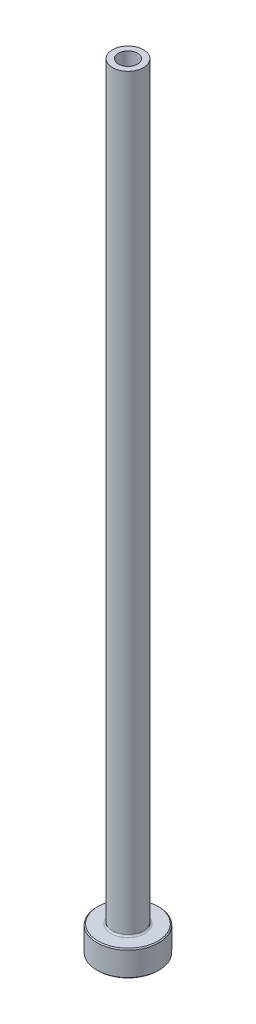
ISO-10303-21;
HEADER;
FILE_DESCRIPTION(('STEP AP214'),'2;1');
FILE_NAME('part.step','',(''),(''),'','','');
FILE_SCHEMA(('AUTOMOTIVE_DESIGN { 1 0 10303 214 1 1 1 1 }'));
ENDSEC;
DATA;
#1=APPLICATION_CONTEXT('core data for automotive mechanical design processes');
#2=APPLICATION_PROTOCOL_DEFINITION('international standard','automotive_design',2000,#1);
#3=PRODUCT_CONTEXT('',#1,'mechanical');
#4=PRODUCT('Part','Part','',(#3));
#5=PRODUCT_RELATED_PRODUCT_CATEGORY('part','',(#4));
#6=PRODUCT_DEFINITION_FORMATION('','',#4);
#7=PRODUCT_DEFINITION_CONTEXT('part definition',#1,'design');
#8=PRODUCT_DEFINITION('design','',#6,#7);
#9=PRODUCT_DEFINITION_SHAPE('','',#8);
#10=(LENGTH_UNIT() NAMED_UNIT(*) SI_UNIT(.MILLI.,.METRE.));
#11=(NAMED_UNIT(*) PLANE_ANGLE_UNIT() SI_UNIT($,.RADIAN.));
#12=(NAMED_UNIT(*) SI_UNIT($,.STERADIAN.) SOLID_ANGLE_UNIT());
#13=UNCERTAINTY_MEASURE_WITH_UNIT(LENGTH_MEASURE(1.E-05),#10,'distance_accuracy_value','');
#14=(GEOMETRIC_REPRESENTATION_CONTEXT(3) GLOBAL_UNCERTAINTY_ASSIGNED_CONTEXT((#13)) GLOBAL_UNIT_ASSIGNED_CONTEXT((#10,
#11,#12)) REPRESENTATION_CONTEXT('',''));
#15=CARTESIAN_POINT('',(0.,0.,0.));
#16=DIRECTION('',(0.,0.,1.));
#17=DIRECTION('',(1.,0.,0.));
#18=AXIS2_PLACEMENT_3D('',#15,#16,#17);
#19=CARTESIAN_POINT('',(0.,92.1876809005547,0.));
#20=DIRECTION('',(0.,1.,0.));
#21=DIRECTION('',(0.,0.,1.));
#22=AXIS2_PLACEMENT_3D('',#19,#20,#21);
#23=CYLINDRICAL_SURFACE('',#22,1.85);
#24=CARTESIAN_POINT('',(0.,150.,0.));
#25=DIRECTION('',(0.,1.,0.));
#26=DIRECTION('',(0.,0.,1.));
#27=AXIS2_PLACEMENT_3D('',#24,#25,#26);
#28=CIRCLE('',#27,1.85);
#29=CARTESIAN_POINT('',(0.,150.,1.85));
#30=VERTEX_POINT('',#29);
#31=EDGE_CURVE('E62',#30,#30,#28,.T.);
#32=ORIENTED_EDGE('',*,*,#31,.T.);
#33=EDGE_LOOP('',(#32));
#34=FACE_BOUND('',#33,.T.);
#35=CARTESIAN_POINT('',(0.,105.,0.));
#36=DIRECTION('',(0.,1.,0.));
#37=DIRECTION('',(0.,0.,1.));
#38=AXIS2_PLACEMENT_3D('',#35,#36,#37);
#39=CIRCLE('',#38,1.85);
#40=CARTESIAN_POINT('',(0.,105.,1.85));
#41=VERTEX_POINT('',#40);
#42=EDGE_CURVE('E71',#41,#41,#39,.T.);
#43=ORIENTED_EDGE('',*,*,#42,.F.);
#44=EDGE_LOOP('',(#43));
#45=FACE_BOUND('',#44,.T.);
#46=ADVANCED_FACE('F30',(#34,#45),#23,.F.);
#47=CARTESIAN_POINT('',(-1.85,150.,0.));
#48=DIRECTION('',(0.,1.,0.));
#49=DIRECTION('',(0.,0.,1.));
#50=AXIS2_PLACEMENT_3D('',#47,#48,#49);
#51=PLANE('',#50);
#52=CARTESIAN_POINT('',(0.,150.,0.));
#53=DIRECTION('',(0.,1.,0.));
#54=DIRECTION('',(0.,0.,1.));
#55=AXIS2_PLACEMENT_3D('',#52,#53,#54);
#56=CIRCLE('',#55,3.00000000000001);
#57=CARTESIAN_POINT('',(0.,150.,3.00000000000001));
#58=VERTEX_POINT('',#57);
#59=EDGE_CURVE('E65',#58,#58,#56,.T.);
#60=ORIENTED_EDGE('',*,*,#59,.T.);
#61=EDGE_LOOP('',(#60));
#62=FACE_BOUND('',#61,.T.);
#63=ORIENTED_EDGE('',*,*,#31,.F.);
#64=EDGE_LOOP('',(#63));
#65=FACE_BOUND('',#64,.T.);
#66=ADVANCED_FACE('F79',(#62,#65),#51,.T.);
#67=CARTESIAN_POINT('',(0.,92.1876809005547,0.));
#68=DIRECTION('',(0.,1.,0.));
#69=DIRECTION('',(0.,0.,1.));
#70=AXIS2_PLACEMENT_3D('',#67,#68,#69);
#71=CYLINDRICAL_SURFACE('',#70,3.);
#72=CARTESIAN_POINT('',(0.,5.3,0.));
#73=DIRECTION('',(0.,1.,0.));
#74=DIRECTION('',(0.,0.,1.));
#75=AXIS2_PLACEMENT_3D('',#72,#73,#74);
#76=CIRCLE('',#75,3.);
#77=CARTESIAN_POINT('',(0.,5.3,3.));
#78=VERTEX_POINT('',#77);
#79=EDGE_CURVE('E59',#78,#78,#76,.T.);
#80=ORIENTED_EDGE('',*,*,#79,.T.);
#81=EDGE_LOOP('',(#80));
#82=FACE_BOUND('',#81,.T.);
#83=ORIENTED_EDGE('',*,*,#59,.F.);
#84=EDGE_LOOP('',(#83));
#85=FACE_BOUND('',#84,.T.);
#86=ADVANCED_FACE('F85',(#82,#85),#71,.T.);
#87=CARTESIAN_POINT('',(-2.99999999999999,5.,0.));
#88=DIRECTION('',(0.,1.,0.));
#89=DIRECTION('',(0.,0.,1.));
#90=AXIS2_PLACEMENT_3D('',#87,#88,#89);
#91=PLANE('',#90);
#92=CARTESIAN_POINT('',(0.,5.,0.));
#93=DIRECTION('',(0.,1.,0.));
#94=DIRECTION('',(0.,0.,1.));
#95=AXIS2_PLACEMENT_3D('',#92,#93,#94);
#96=CIRCLE('',#95,5.80000000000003);
#97=CARTESIAN_POINT('',(0.,5.,5.80000000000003));
#98=VERTEX_POINT('',#97);
#99=EDGE_CURVE('E53',#98,#98,#96,.T.);
#100=ORIENTED_EDGE('',*,*,#99,.T.);
#101=EDGE_LOOP('',(#100));
#102=FACE_BOUND('',#101,.T.);
#103=CARTESIAN_POINT('',(0.,5.,0.));
#104=DIRECTION('',(0.,1.,0.));
#105=DIRECTION('',(0.,0.,1.));
#106=AXIS2_PLACEMENT_3D('',#103,#104,#105);
#107=CIRCLE('',#106,3.3);
#108=CARTESIAN_POINT('',(0.,5.,3.3));
#109=VERTEX_POINT('',#108);
#110=EDGE_CURVE('E56',#109,#109,#107,.F.);
#111=ORIENTED_EDGE('',*,*,#110,.T.);
#112=EDGE_LOOP('',(#111));
#113=FACE_BOUND('',#112,.T.);
#114=ADVANCED_FACE('F111',(#102,#113),#91,.T.);
#115=CARTESIAN_POINT('',(0.,92.1876809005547,0.));
#116=DIRECTION('',(0.,1.,0.));
#117=DIRECTION('',(0.,0.,1.));
#118=AXIS2_PLACEMENT_3D('',#115,#116,#117);
#119=CYLINDRICAL_SURFACE('',#118,5.99999999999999);
#120=CARTESIAN_POINT('',(0.,4.80000000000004,0.));
#121=DIRECTION('',(0.,1.,0.));
#122=DIRECTION('',(0.,0.,1.));
#123=AXIS2_PLACEMENT_3D('',#120,#121,#122);
#124=CIRCLE('',#123,5.99999999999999);
#125=CARTESIAN_POINT('',(0.,4.80000000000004,5.99999999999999));
#126=VERTEX_POINT('',#125);
#127=EDGE_CURVE('E45',#126,#126,#124,.F.);
#128=ORIENTED_EDGE('',*,*,#127,.T.);
#129=EDGE_LOOP('',(#128));
#130=FACE_BOUND('',#129,.T.);
#131=CARTESIAN_POINT('',(0.,0.200000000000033,0.));
#132=DIRECTION('',(0.,-1.,0.));
#133=DIRECTION('',(0.,0.,-1.));
#134=AXIS2_PLACEMENT_3D('',#131,#132,#133);
#135=CIRCLE('',#134,5.99999999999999);
#136=CARTESIAN_POINT('',(0.,0.200000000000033,-5.99999999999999));
#137=VERTEX_POINT('',#136);
#138=EDGE_CURVE('E50',#137,#137,#135,.F.);
#139=ORIENTED_EDGE('',*,*,#138,.T.);
#140=EDGE_LOOP('',(#139));
#141=FACE_BOUND('',#140,.T.);
#142=ADVANCED_FACE('F108',(#130,#141),#119,.T.);
#143=CARTESIAN_POINT('',(-5.99999999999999,0.,0.));
#144=DIRECTION('',(0.,-1.,0.));
#145=DIRECTION('',(0.,0.,-1.));
#146=AXIS2_PLACEMENT_3D('',#143,#144,#145);
#147=PLANE('',#146);
#148=CARTESIAN_POINT('',(0.,0.,0.));
#149=DIRECTION('',(0.,-1.,0.));
#150=DIRECTION('',(0.,0.,-1.));
#151=AXIS2_PLACEMENT_3D('',#148,#149,#150);
#152=CIRCLE('',#151,2.59999999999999);
#153=CARTESIAN_POINT('',(0.,0.,-2.59999999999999));
#154=VERTEX_POINT('',#153);
#155=EDGE_CURVE('E37',#154,#154,#152,.F.);
#156=ORIENTED_EDGE('',*,*,#155,.T.);
#157=EDGE_LOOP('',(#156));
#158=FACE_BOUND('',#157,.T.);
#159=CARTESIAN_POINT('',(0.,0.,0.));
#160=DIRECTION('',(0.,-1.,0.));
#161=DIRECTION('',(0.,0.,-1.));
#162=AXIS2_PLACEMENT_3D('',#159,#160,#161);
#163=CIRCLE('',#162,5.79999999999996);
#164=CARTESIAN_POINT('',(0.,0.,-5.79999999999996));
#165=VERTEX_POINT('',#164);
#166=EDGE_CURVE('E41',#165,#165,#163,.T.);
#167=ORIENTED_EDGE('',*,*,#166,.T.);
#168=EDGE_LOOP('',(#167));
#169=FACE_BOUND('',#168,.T.);
#170=ADVANCED_FACE('F110',(#158,#169),#147,.T.);
#171=CARTESIAN_POINT('',(0.,92.1876809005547,0.));
#172=DIRECTION('',(0.,1.,0.));
#173=DIRECTION('',(0.,0.,1.));
#174=AXIS2_PLACEMENT_3D('',#171,#172,#173);
#175=CYLINDRICAL_SURFACE('',#174,2.1);
#176=CARTESIAN_POINT('',(0.,0.5,0.));
#177=DIRECTION('',(0.,-1.,0.));
#178=DIRECTION('',(0.,0.,-1.));
#179=AXIS2_PLACEMENT_3D('',#176,#177,#178);
#180=CIRCLE('',#179,2.1);
#181=CARTESIAN_POINT('',(0.,0.5,-2.1));
#182=VERTEX_POINT('',#181);
#183=EDGE_CURVE('E10',#182,#182,#180,.T.);
#184=ORIENTED_EDGE('',*,*,#183,.T.);
#185=EDGE_LOOP('',(#184));
#186=FACE_BOUND('',#185,.T.);
#187=CARTESIAN_POINT('',(0.,93.,0.));
#188=DIRECTION('',(0.,1.,0.));
#189=DIRECTION('',(0.,0.,1.));
#190=AXIS2_PLACEMENT_3D('',#187,#188,#189);
#191=CIRCLE('',#190,2.1);
#192=CARTESIAN_POINT('',(0.,93.,2.1));
#193=VERTEX_POINT('',#192);
#194=EDGE_CURVE('E68',#193,#193,#191,.T.);
#195=ORIENTED_EDGE('',*,*,#194,.T.);
#196=EDGE_LOOP('',(#195));
#197=FACE_BOUND('',#196,.T.);
#198=ADVANCED_FACE('F118',(#186,#197),#175,.F.);
#199=CARTESIAN_POINT('',(0.,93.,0.));
#200=DIRECTION('',(0.,-1.,0.));
#201=DIRECTION('',(0.,0.,-1.));
#202=AXIS2_PLACEMENT_3D('',#199,#200,#201);
#203=CONICAL_SURFACE('',#202,2.1,0.0208303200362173);
#204=ORIENTED_EDGE('',*,*,#42,.T.);
#205=EDGE_LOOP('',(#204));
#206=FACE_BOUND('',#205,.T.);
#207=ORIENTED_EDGE('',*,*,#194,.F.);
#208=EDGE_LOOP('',(#207));
#209=FACE_BOUND('',#208,.T.);
#210=ADVANCED_FACE('F75',(#206,#209),#203,.F.);
#211=CARTESIAN_POINT('',(0.,5.3,0.));
#212=DIRECTION('',(0.,1.,0.));
#213=DIRECTION('',(0.,0.,1.));
#214=AXIS2_PLACEMENT_3D('',#211,#212,#213);
#215=TOROIDAL_SURFACE('',#214,3.3,0.3);
#216=ORIENTED_EDGE('',*,*,#110,.F.);
#217=EDGE_LOOP('',(#216));
#218=FACE_BOUND('',#217,.T.);
#219=ORIENTED_EDGE('',*,*,#79,.F.);
#220=EDGE_LOOP('',(#219));
#221=FACE_BOUND('',#220,.T.);
#222=ADVANCED_FACE('F90',(#218,#221),#215,.F.);
#223=CARTESIAN_POINT('',(0.,5.,0.));
#224=DIRECTION('',(0.,-1.,0.));
#225=DIRECTION('',(0.,0.,-1.));
#226=AXIS2_PLACEMENT_3D('',#223,#224,#225);
#227=CONICAL_SURFACE('',#226,5.80000000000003,0.785398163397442);
#228=ORIENTED_EDGE('',*,*,#127,.F.);
#229=EDGE_LOOP('',(#228));
#230=FACE_BOUND('',#229,.T.);
#231=ORIENTED_EDGE('',*,*,#99,.F.);
#232=EDGE_LOOP('',(#231));
#233=FACE_BOUND('',#232,.T.);
#234=ADVANCED_FACE('F93',(#230,#233),#227,.T.);
#235=CARTESIAN_POINT('',(0.,0.200000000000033,0.));
#236=DIRECTION('',(0.,1.,0.));
#237=DIRECTION('',(0.,0.,1.));
#238=AXIS2_PLACEMENT_3D('',#235,#236,#237);
#239=CONICAL_SURFACE('',#238,5.99999999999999,0.78539816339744);
#240=ORIENTED_EDGE('',*,*,#166,.F.);
#241=EDGE_LOOP('',(#240));
#242=FACE_BOUND('',#241,.T.);
#243=ORIENTED_EDGE('',*,*,#138,.F.);
#244=EDGE_LOOP('',(#243));
#245=FACE_BOUND('',#244,.T.);
#246=ADVANCED_FACE('F96',(#242,#245),#239,.T.);
#247=CARTESIAN_POINT('',(0.,0.,0.));
#248=DIRECTION('',(0.,-1.,0.));
#249=DIRECTION('',(0.,0.,-1.));
#250=AXIS2_PLACEMENT_3D('',#247,#248,#249);
#251=CONICAL_SURFACE('',#250,2.59999999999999,0.785398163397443);
#252=ORIENTED_EDGE('',*,*,#183,.F.);
#253=EDGE_LOOP('',(#252));
#254=FACE_BOUND('',#253,.T.);
#255=ORIENTED_EDGE('',*,*,#155,.F.);
#256=EDGE_LOOP('',(#255));
#257=FACE_BOUND('',#256,.T.);
#258=ADVANCED_FACE('F32',(#254,#257),#251,.F.);
#259=CLOSED_SHELL('',(#46,#66,#86,#114,#142,#170,#198,#210,#222,#234,#246,#258));
#260=MANIFOLD_SOLID_BREP('B2',#259);
#261=ADVANCED_BREP_SHAPE_REPRESENTATION('',(#18,#260),#14);
#262=SHAPE_DEFINITION_REPRESENTATION(#9,#261);
ENDSEC;
END-ISO-10303-21;
